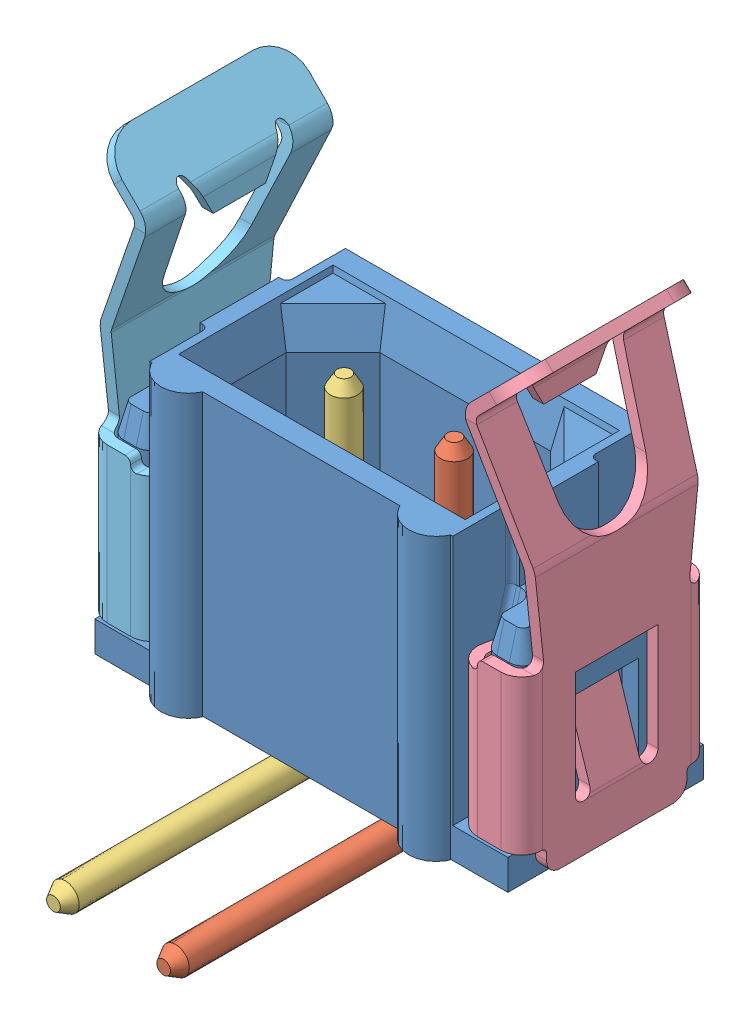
SolidWorks assembly m80-8420242_asm.SLDASM, configuration Default (file format 6000). Lengths in mm.
Overall size (7.9 9.1 7.05).
6 component instances, 5 part files, 0 mates.
Components (placement in the parent):
- M80-8780222-1: M80-8780222.sldasm [Default] at origin size (7.5 6.15 7.05)
  - M80-1000298-1: M80-1000298.sldprt [Default] at origin size (7.5 5.4 3.85)
  - M80-878-PIN-1: M80-878-PIN.sldprt [Default] at origin size (0.8 5.95 5.68)
  - M80-878-PIN_1-1: M80-878-PIN_1.sldprt [Default] at origin size (0.8 5.95 5.68)
- M80-001XXXX_3-1: M80-001XXXX_3.sldprt [Default] at origin size (1.2 7.95 3.45)
- M80-001XXXX_1_2-1: M80-001XXXX_1_2.sldprt [Default] at origin size (1.2 7.95 3.45)
